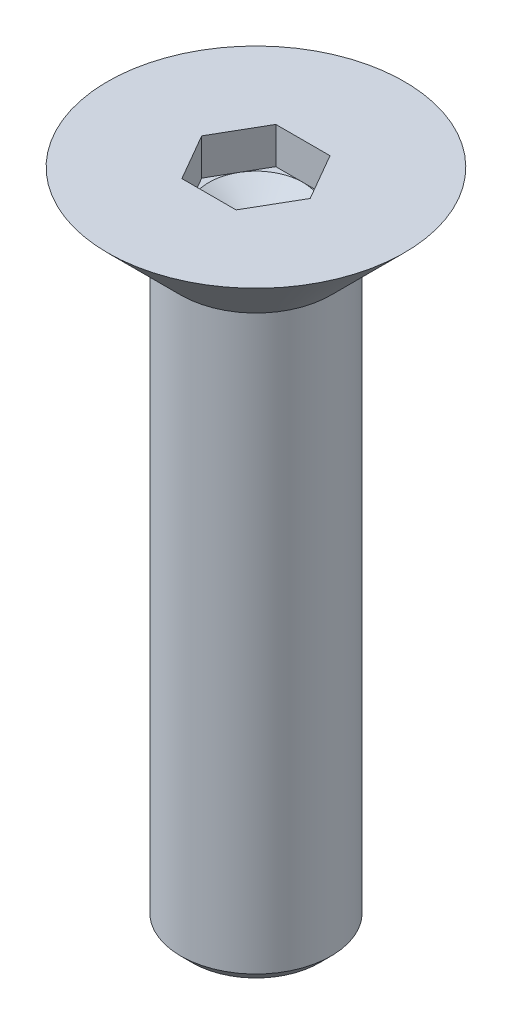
ISO-10303-21;
HEADER;
FILE_DESCRIPTION(('STEP AP214'),'2;1');
FILE_NAME('part.step','',(''),(''),'','','');
FILE_SCHEMA(('AUTOMOTIVE_DESIGN { 1 0 10303 214 1 1 1 1 }'));
ENDSEC;
DATA;
#1=APPLICATION_CONTEXT('core data for automotive mechanical design processes');
#2=APPLICATION_PROTOCOL_DEFINITION('international standard','automotive_design',2000,#1);
#3=PRODUCT_CONTEXT('',#1,'mechanical');
#4=PRODUCT('Part','Part','',(#3));
#5=PRODUCT_RELATED_PRODUCT_CATEGORY('part','',(#4));
#6=PRODUCT_DEFINITION_FORMATION('','',#4);
#7=PRODUCT_DEFINITION_CONTEXT('part definition',#1,'design');
#8=PRODUCT_DEFINITION('design','',#6,#7);
#9=PRODUCT_DEFINITION_SHAPE('','',#8);
#10=(LENGTH_UNIT() NAMED_UNIT(*) SI_UNIT(.MILLI.,.METRE.));
#11=(NAMED_UNIT(*) PLANE_ANGLE_UNIT() SI_UNIT($,.RADIAN.));
#12=(NAMED_UNIT(*) SI_UNIT($,.STERADIAN.) SOLID_ANGLE_UNIT());
#13=UNCERTAINTY_MEASURE_WITH_UNIT(LENGTH_MEASURE(1.E-05),#10,'distance_accuracy_value','');
#14=(GEOMETRIC_REPRESENTATION_CONTEXT(3) GLOBAL_UNCERTAINTY_ASSIGNED_CONTEXT((#13)) GLOBAL_UNIT_ASSIGNED_CONTEXT((#10,
#11,#12)) REPRESENTATION_CONTEXT('',''));
#15=CARTESIAN_POINT('',(0.,0.,0.));
#16=DIRECTION('',(0.,0.,1.));
#17=DIRECTION('',(1.,0.,0.));
#18=AXIS2_PLACEMENT_3D('',#15,#16,#17);
#19=CARTESIAN_POINT('',(0.,-35.,0.));
#20=DIRECTION('',(0.,1.,0.));
#21=DIRECTION('',(0.,0.,1.));
#22=AXIS2_PLACEMENT_3D('',#19,#20,#21);
#23=CYLINDRICAL_SURFACE('',#22,4.);
#24=CARTESIAN_POINT('',(0.,-34.375,0.));
#25=DIRECTION('',(0.,1.,0.));
#26=DIRECTION('',(0.,0.,1.));
#27=AXIS2_PLACEMENT_3D('',#24,#25,#26);
#28=CIRCLE('',#27,4.);
#29=CARTESIAN_POINT('',(0.,-34.375,4.));
#30=VERTEX_POINT('',#29);
#31=EDGE_CURVE('E45',#30,#30,#28,.T.);
#32=ORIENTED_EDGE('',*,*,#31,.T.);
#33=EDGE_LOOP('',(#32));
#34=FACE_BOUND('',#33,.T.);
#35=CARTESIAN_POINT('',(0.,-3.89999999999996,0.));
#36=DIRECTION('',(0.,1.,0.));
#37=DIRECTION('',(0.,0.,1.));
#38=AXIS2_PLACEMENT_3D('',#35,#36,#37);
#39=CIRCLE('',#38,4.);
#40=CARTESIAN_POINT('',(0.,-3.89999999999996,4.));
#41=VERTEX_POINT('',#40);
#42=EDGE_CURVE('E155',#41,#41,#39,.T.);
#43=ORIENTED_EDGE('',*,*,#42,.F.);
#44=EDGE_LOOP('',(#43));
#45=FACE_BOUND('',#44,.T.);
#46=ADVANCED_FACE('F37',(#34,#45),#23,.T.);
#47=CARTESIAN_POINT('',(0.,-35.,0.));
#48=DIRECTION('',(0.,1.,0.));
#49=DIRECTION('',(0.,0.,1.));
#50=AXIS2_PLACEMENT_3D('',#47,#48,#49);
#51=PLANE('',#50);
#52=CARTESIAN_POINT('',(0.,-35.,0.));
#53=DIRECTION('',(0.,1.,0.));
#54=DIRECTION('',(0.,0.,1.));
#55=AXIS2_PLACEMENT_3D('',#52,#53,#54);
#56=CIRCLE('',#55,3.375);
#57=CARTESIAN_POINT('',(0.,-35.,3.375));
#58=VERTEX_POINT('',#57);
#59=EDGE_CURVE('E11',#58,#58,#56,.F.);
#60=ORIENTED_EDGE('',*,*,#59,.T.);
#61=EDGE_LOOP('',(#60));
#62=FACE_BOUND('',#61,.T.);
#63=ADVANCED_FACE('F174',(#62),#51,.F.);
#64=CARTESIAN_POINT('',(0.,-34.375,0.));
#65=DIRECTION('',(0.,1.,0.));
#66=DIRECTION('',(0.,0.,1.));
#67=AXIS2_PLACEMENT_3D('',#64,#65,#66);
#68=CONICAL_SURFACE('',#67,4.,0.78539816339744);
#69=ORIENTED_EDGE('',*,*,#59,.F.);
#70=EDGE_LOOP('',(#69));
#71=FACE_BOUND('',#70,.T.);
#72=ORIENTED_EDGE('',*,*,#31,.F.);
#73=EDGE_LOOP('',(#72));
#74=FACE_BOUND('',#73,.T.);
#75=ADVANCED_FACE('F171',(#71,#74),#68,.T.);
#76=CARTESIAN_POINT('',(0.,-3.89999999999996,0.));
#77=DIRECTION('',(0.,1.,0.));
#78=DIRECTION('',(0.,0.,1.));
#79=AXIS2_PLACEMENT_3D('',#76,#77,#78);
#80=CONICAL_SURFACE('',#79,4.,0.785398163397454);
#81=CARTESIAN_POINT('',(0.,0.,0.));
#82=DIRECTION('',(0.,1.,0.));
#83=DIRECTION('',(0.,0.,1.));
#84=AXIS2_PLACEMENT_3D('',#81,#82,#83);
#85=CIRCLE('',#84,7.9);
#86=CARTESIAN_POINT('',(0.,0.,7.9));
#87=VERTEX_POINT('',#86);
#88=EDGE_CURVE('E161',#87,#87,#85,.T.);
#89=ORIENTED_EDGE('',*,*,#88,.F.);
#90=EDGE_LOOP('',(#89));
#91=FACE_BOUND('',#90,.T.);
#92=ORIENTED_EDGE('',*,*,#42,.T.);
#93=EDGE_LOOP('',(#92));
#94=FACE_BOUND('',#93,.T.);
#95=ADVANCED_FACE('F173',(#91,#94),#80,.T.);
#96=CARTESIAN_POINT('',(0.,0.,0.));
#97=DIRECTION('',(0.,1.,0.));
#98=DIRECTION('',(0.,0.,1.));
#99=AXIS2_PLACEMENT_3D('',#96,#97,#98);
#100=PLANE('',#99);
#101=DIRECTION('',(0.499999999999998,0.,-0.86602540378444));
#102=VECTOR('',#101,1.);
#103=CARTESIAN_POINT('',(1.44337567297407,0.,2.5));
#104=LINE('',#103,#102);
#105=CARTESIAN_POINT('',(1.44337567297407,0.,2.5));
#106=VERTEX_POINT('',#105);
#107=CARTESIAN_POINT('',(2.88675134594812,0.,0.));
#108=VERTEX_POINT('',#107);
#109=EDGE_CURVE('E398',#106,#108,#104,.T.);
#110=ORIENTED_EDGE('',*,*,#109,.F.);
#111=DIRECTION('',(1.,0.,0.));
#112=VECTOR('',#111,1.);
#113=CARTESIAN_POINT('',(-1.44337567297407,0.,2.5));
#114=LINE('',#113,#112);
#115=CARTESIAN_POINT('',(-1.44337567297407,0.,2.5));
#116=VERTEX_POINT('',#115);
#117=EDGE_CURVE('E396',#116,#106,#114,.T.);
#118=ORIENTED_EDGE('',*,*,#117,.F.);
#119=DIRECTION('',(0.499999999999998,0.,0.86602540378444));
#120=VECTOR('',#119,1.);
#121=CARTESIAN_POINT('',(-1.44337567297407,0.,2.5));
#122=LINE('',#121,#120);
#123=CARTESIAN_POINT('',(-2.88675134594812,0.,0.));
#124=VERTEX_POINT('',#123);
#125=EDGE_CURVE('E114',#124,#116,#122,.T.);
#126=ORIENTED_EDGE('',*,*,#125,.F.);
#127=DIRECTION('',(-0.499999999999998,0.,0.86602540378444));
#128=VECTOR('',#127,1.);
#129=CARTESIAN_POINT('',(-1.44337567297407,0.,-2.5));
#130=LINE('',#129,#128);
#131=CARTESIAN_POINT('',(-1.44337567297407,0.,-2.5));
#132=VERTEX_POINT('',#131);
#133=EDGE_CURVE('E107',#132,#124,#130,.T.);
#134=ORIENTED_EDGE('',*,*,#133,.F.);
#135=DIRECTION('',(-1.,0.,0.));
#136=VECTOR('',#135,1.);
#137=CARTESIAN_POINT('',(-1.44337567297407,0.,-2.5));
#138=LINE('',#137,#136);
#139=CARTESIAN_POINT('',(1.44337567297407,0.,-2.5));
#140=VERTEX_POINT('',#139);
#141=EDGE_CURVE('E111',#140,#132,#138,.T.);
#142=ORIENTED_EDGE('',*,*,#141,.F.);
#143=DIRECTION('',(-0.499999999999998,0.,-0.86602540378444));
#144=VECTOR('',#143,1.);
#145=CARTESIAN_POINT('',(1.44337567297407,0.,-2.5));
#146=LINE('',#145,#144);
#147=EDGE_CURVE('E403',#108,#140,#146,.T.);
#148=ORIENTED_EDGE('',*,*,#147,.F.);
#149=EDGE_LOOP('',(#110,#118,#126,#134,#142,#148));
#150=FACE_BOUND('',#149,.T.);
#151=ORIENTED_EDGE('',*,*,#88,.T.);
#152=EDGE_LOOP('',(#151));
#153=FACE_BOUND('',#152,.T.);
#154=ADVANCED_FACE('F109',(#150,#153),#100,.T.);
#155=CARTESIAN_POINT('',(-1.44337567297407,-1.95,-2.5));
#156=DIRECTION('',(0.,0.,-1.));
#157=DIRECTION('',(-1.,0.,0.));
#158=AXIS2_PLACEMENT_3D('',#155,#156,#157);
#159=PLANE('',#158);
#160=ORIENTED_EDGE('',*,*,#141,.T.);
#161=DIRECTION('',(0.,1.,0.));
#162=VECTOR('',#161,1.);
#163=CARTESIAN_POINT('',(-1.44337567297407,-1.95,-2.5));
#164=LINE('',#163,#162);
#165=CARTESIAN_POINT('',(-1.44337567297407,-1.95,-2.5));
#166=VERTEX_POINT('',#165);
#167=EDGE_CURVE('E126',#166,#132,#164,.T.);
#168=ORIENTED_EDGE('',*,*,#167,.F.);
#169=DIRECTION('',(-1.,0.,0.));
#170=VECTOR('',#169,1.);
#171=CARTESIAN_POINT('',(-1.44337567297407,-1.95,-2.5));
#172=LINE('',#171,#170);
#173=CARTESIAN_POINT('',(0.,-1.95,-2.5));
#174=VERTEX_POINT('',#173);
#175=EDGE_CURVE('E410',#174,#166,#172,.T.);
#176=ORIENTED_EDGE('',*,*,#175,.F.);
#177=CARTESIAN_POINT('',(1.44337567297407,-1.95,-2.5));
#178=VERTEX_POINT('',#177);
#179=EDGE_CURVE('E411',#178,#174,#172,.T.);
#180=ORIENTED_EDGE('',*,*,#179,.F.);
#181=DIRECTION('',(0.,1.,0.));
#182=VECTOR('',#181,1.);
#183=CARTESIAN_POINT('',(1.44337567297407,-1.95,-2.5));
#184=LINE('',#183,#182);
#185=EDGE_CURVE('E130',#178,#140,#184,.T.);
#186=ORIENTED_EDGE('',*,*,#185,.T.);
#187=EDGE_LOOP('',(#160,#168,#176,#180,#186));
#188=FACE_BOUND('',#187,.T.);
#189=ADVANCED_FACE('F124',(#188),#159,.F.);
#190=CARTESIAN_POINT('',(1.44337567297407,-1.95,-2.5));
#191=DIRECTION('',(0.86602540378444,0.,-0.499999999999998));
#192=DIRECTION('',(-0.499999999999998,0.,-0.86602540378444));
#193=AXIS2_PLACEMENT_3D('',#190,#191,#192);
#194=PLANE('',#193);
#195=ORIENTED_EDGE('',*,*,#147,.T.);
#196=ORIENTED_EDGE('',*,*,#185,.F.);
#197=DIRECTION('',(-0.499999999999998,0.,-0.86602540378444));
#198=VECTOR('',#197,1.);
#199=CARTESIAN_POINT('',(1.44337567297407,-1.95,-2.5));
#200=LINE('',#199,#198);
#201=CARTESIAN_POINT('',(2.1650635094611,-1.95,-1.25));
#202=VERTEX_POINT('',#201);
#203=EDGE_CURVE('E148',#202,#178,#200,.T.);
#204=ORIENTED_EDGE('',*,*,#203,.F.);
#205=CARTESIAN_POINT('',(2.88675134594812,-1.95,0.));
#206=VERTEX_POINT('',#205);
#207=EDGE_CURVE('E139',#206,#202,#200,.T.);
#208=ORIENTED_EDGE('',*,*,#207,.F.);
#209=DIRECTION('',(0.,1.,0.));
#210=VECTOR('',#209,1.);
#211=CARTESIAN_POINT('',(2.88675134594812,-1.95,0.));
#212=LINE('',#211,#210);
#213=EDGE_CURVE('E388',#206,#108,#212,.T.);
#214=ORIENTED_EDGE('',*,*,#213,.T.);
#215=EDGE_LOOP('',(#195,#196,#204,#208,#214));
#216=FACE_BOUND('',#215,.T.);
#217=ADVANCED_FACE('F213',(#216),#194,.F.);
#218=CARTESIAN_POINT('',(1.44337567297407,-1.95,2.5));
#219=DIRECTION('',(0.86602540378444,0.,0.499999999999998));
#220=DIRECTION('',(0.499999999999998,0.,-0.86602540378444));
#221=AXIS2_PLACEMENT_3D('',#218,#219,#220);
#222=PLANE('',#221);
#223=ORIENTED_EDGE('',*,*,#109,.T.);
#224=ORIENTED_EDGE('',*,*,#213,.F.);
#225=DIRECTION('',(0.499999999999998,0.,-0.86602540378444));
#226=VECTOR('',#225,1.);
#227=CARTESIAN_POINT('',(1.44337567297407,-1.95,2.5));
#228=LINE('',#227,#226);
#229=CARTESIAN_POINT('',(2.1650635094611,-1.95,1.24999999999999));
#230=VERTEX_POINT('',#229);
#231=EDGE_CURVE('E379',#230,#206,#228,.T.);
#232=ORIENTED_EDGE('',*,*,#231,.F.);
#233=CARTESIAN_POINT('',(1.44337567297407,-1.95,2.5));
#234=VERTEX_POINT('',#233);
#235=EDGE_CURVE('E52',#234,#230,#228,.T.);
#236=ORIENTED_EDGE('',*,*,#235,.F.);
#237=DIRECTION('',(0.,1.,0.));
#238=VECTOR('',#237,1.);
#239=CARTESIAN_POINT('',(1.44337567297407,-1.95,2.5));
#240=LINE('',#239,#238);
#241=EDGE_CURVE('E371',#234,#106,#240,.T.);
#242=ORIENTED_EDGE('',*,*,#241,.T.);
#243=EDGE_LOOP('',(#223,#224,#232,#236,#242));
#244=FACE_BOUND('',#243,.T.);
#245=ADVANCED_FACE('F221',(#244),#222,.F.);
#246=CARTESIAN_POINT('',(-1.44337567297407,-1.95,2.5));
#247=DIRECTION('',(0.,0.,1.));
#248=DIRECTION('',(1.,0.,0.));
#249=AXIS2_PLACEMENT_3D('',#246,#247,#248);
#250=PLANE('',#249);
#251=ORIENTED_EDGE('',*,*,#117,.T.);
#252=ORIENTED_EDGE('',*,*,#241,.F.);
#253=DIRECTION('',(1.,0.,0.));
#254=VECTOR('',#253,1.);
#255=CARTESIAN_POINT('',(-1.44337567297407,-1.95,2.5));
#256=LINE('',#255,#254);
#257=CARTESIAN_POINT('',(0.,-1.95,2.5));
#258=VERTEX_POINT('',#257);
#259=EDGE_CURVE('E363',#258,#234,#256,.T.);
#260=ORIENTED_EDGE('',*,*,#259,.F.);
#261=CARTESIAN_POINT('',(-1.44337567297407,-1.95,2.5));
#262=VERTEX_POINT('',#261);
#263=EDGE_CURVE('E369',#262,#258,#256,.T.);
#264=ORIENTED_EDGE('',*,*,#263,.F.);
#265=DIRECTION('',(0.,1.,0.));
#266=VECTOR('',#265,1.);
#267=CARTESIAN_POINT('',(-1.44337567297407,-1.95,2.5));
#268=LINE('',#267,#266);
#269=EDGE_CURVE('E144',#262,#116,#268,.T.);
#270=ORIENTED_EDGE('',*,*,#269,.T.);
#271=EDGE_LOOP('',(#251,#252,#260,#264,#270));
#272=FACE_BOUND('',#271,.T.);
#273=ADVANCED_FACE('F230',(#272),#250,.F.);
#274=CARTESIAN_POINT('',(-1.44337567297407,-1.95,2.5));
#275=DIRECTION('',(-0.86602540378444,0.,0.499999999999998));
#276=DIRECTION('',(0.499999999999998,0.,0.86602540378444));
#277=AXIS2_PLACEMENT_3D('',#274,#275,#276);
#278=PLANE('',#277);
#279=ORIENTED_EDGE('',*,*,#125,.T.);
#280=ORIENTED_EDGE('',*,*,#269,.F.);
#281=DIRECTION('',(0.499999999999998,0.,0.86602540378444));
#282=VECTOR('',#281,1.);
#283=CARTESIAN_POINT('',(-1.44337567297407,-1.95,2.5));
#284=LINE('',#283,#282);
#285=CARTESIAN_POINT('',(-2.1650635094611,-1.95,1.24999999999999));
#286=VERTEX_POINT('',#285);
#287=EDGE_CURVE('E376',#286,#262,#284,.T.);
#288=ORIENTED_EDGE('',*,*,#287,.F.);
#289=CARTESIAN_POINT('',(-2.88675134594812,-1.95,0.));
#290=VERTEX_POINT('',#289);
#291=EDGE_CURVE('E373',#290,#286,#284,.T.);
#292=ORIENTED_EDGE('',*,*,#291,.F.);
#293=DIRECTION('',(0.,1.,0.));
#294=VECTOR('',#293,1.);
#295=CARTESIAN_POINT('',(-2.88675134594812,-1.95,0.));
#296=LINE('',#295,#294);
#297=EDGE_CURVE('E138',#290,#124,#296,.T.);
#298=ORIENTED_EDGE('',*,*,#297,.T.);
#299=EDGE_LOOP('',(#279,#280,#288,#292,#298));
#300=FACE_BOUND('',#299,.T.);
#301=ADVANCED_FACE('F239',(#300),#278,.F.);
#302=CARTESIAN_POINT('',(-1.44337567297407,-1.95,-2.5));
#303=DIRECTION('',(-0.86602540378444,0.,-0.499999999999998));
#304=DIRECTION('',(-0.499999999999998,0.,0.86602540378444));
#305=AXIS2_PLACEMENT_3D('',#302,#303,#304);
#306=PLANE('',#305);
#307=ORIENTED_EDGE('',*,*,#133,.T.);
#308=ORIENTED_EDGE('',*,*,#297,.F.);
#309=DIRECTION('',(-0.499999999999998,0.,0.86602540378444));
#310=VECTOR('',#309,1.);
#311=CARTESIAN_POINT('',(-1.44337567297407,-1.95,-2.5));
#312=LINE('',#311,#310);
#313=CARTESIAN_POINT('',(-2.1650635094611,-1.95,-1.25));
#314=VERTEX_POINT('',#313);
#315=EDGE_CURVE('E414',#314,#290,#312,.T.);
#316=ORIENTED_EDGE('',*,*,#315,.F.);
#317=EDGE_CURVE('E136',#166,#314,#312,.T.);
#318=ORIENTED_EDGE('',*,*,#317,.F.);
#319=ORIENTED_EDGE('',*,*,#167,.T.);
#320=EDGE_LOOP('',(#307,#308,#316,#318,#319));
#321=FACE_BOUND('',#320,.T.);
#322=ADVANCED_FACE('F133',(#321),#306,.F.);
#323=CARTESIAN_POINT('',(4.33012701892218,-1.95,-2.5));
#324=DIRECTION('',(0.,1.,0.));
#325=DIRECTION('',(0.,0.,1.));
#326=AXIS2_PLACEMENT_3D('',#323,#324,#325);
#327=PLANE('',#326);
#328=CARTESIAN_POINT('',(0.,-1.95,0.));
#329=DIRECTION('',(0.,1.,0.));
#330=DIRECTION('',(0.,0.,1.));
#331=AXIS2_PLACEMENT_3D('',#328,#329,#330);
#332=CIRCLE('',#331,2.5);
#333=EDGE_CURVE('E157',#286,#258,#332,.T.);
#334=ORIENTED_EDGE('',*,*,#333,.F.);
#335=ORIENTED_EDGE('',*,*,#287,.T.);
#336=ORIENTED_EDGE('',*,*,#263,.T.);
#337=EDGE_LOOP('',(#334,#335,#336));
#338=FACE_BOUND('',#337,.T.);
#339=ADVANCED_FACE('F256',(#338),#327,.T.);
#340=EDGE_CURVE('E420',#314,#286,#332,.T.);
#341=ORIENTED_EDGE('',*,*,#340,.F.);
#342=ORIENTED_EDGE('',*,*,#315,.T.);
#343=ORIENTED_EDGE('',*,*,#291,.T.);
#344=EDGE_LOOP('',(#341,#342,#343));
#345=FACE_BOUND('',#344,.T.);
#346=ADVANCED_FACE('F264',(#345),#327,.T.);
#347=EDGE_CURVE('E424',#174,#314,#332,.T.);
#348=ORIENTED_EDGE('',*,*,#347,.F.);
#349=ORIENTED_EDGE('',*,*,#175,.T.);
#350=ORIENTED_EDGE('',*,*,#317,.T.);
#351=EDGE_LOOP('',(#348,#349,#350));
#352=FACE_BOUND('',#351,.T.);
#353=ADVANCED_FACE('F274',(#352),#327,.T.);
#354=EDGE_CURVE('E423',#202,#174,#332,.T.);
#355=ORIENTED_EDGE('',*,*,#354,.F.);
#356=ORIENTED_EDGE('',*,*,#203,.T.);
#357=ORIENTED_EDGE('',*,*,#179,.T.);
#358=EDGE_LOOP('',(#355,#356,#357));
#359=FACE_BOUND('',#358,.T.);
#360=ADVANCED_FACE('F282',(#359),#327,.T.);
#361=EDGE_CURVE('E156',#230,#202,#332,.T.);
#362=ORIENTED_EDGE('',*,*,#361,.F.);
#363=ORIENTED_EDGE('',*,*,#231,.T.);
#364=ORIENTED_EDGE('',*,*,#207,.T.);
#365=EDGE_LOOP('',(#362,#363,#364));
#366=FACE_BOUND('',#365,.T.);
#367=ADVANCED_FACE('F290',(#366),#327,.T.);
#368=EDGE_CURVE('E152',#258,#230,#332,.T.);
#369=ORIENTED_EDGE('',*,*,#368,.F.);
#370=ORIENTED_EDGE('',*,*,#259,.T.);
#371=ORIENTED_EDGE('',*,*,#235,.T.);
#372=EDGE_LOOP('',(#369,#370,#371));
#373=FACE_BOUND('',#372,.T.);
#374=ADVANCED_FACE('F267',(#373),#327,.T.);
#375=CARTESIAN_POINT('',(0.,-1.95,0.));
#376=DIRECTION('',(0.,1.,0.));
#377=DIRECTION('',(0.,0.,1.));
#378=AXIS2_PLACEMENT_3D('',#375,#376,#377);
#379=CONICAL_SURFACE('',#378,2.5,1.0471975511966);
#380=CARTESIAN_POINT('',(0.,-3.39337567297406,0.));
#381=VERTEX_POINT('',#380);
#382=VERTEX_LOOP('',#381);
#383=FACE_BOUND('',#382,.T.);
#384=ORIENTED_EDGE('',*,*,#368,.T.);
#385=ORIENTED_EDGE('',*,*,#361,.T.);
#386=ORIENTED_EDGE('',*,*,#354,.T.);
#387=ORIENTED_EDGE('',*,*,#347,.T.);
#388=ORIENTED_EDGE('',*,*,#340,.T.);
#389=ORIENTED_EDGE('',*,*,#333,.T.);
#390=EDGE_LOOP('',(#384,#385,#386,#387,#388,#389));
#391=FACE_BOUND('',#390,.T.);
#392=ADVANCED_FACE('F305',(#383,#391),#379,.F.);
#393=CLOSED_SHELL('',(#46,#63,#75,#95,#154,#189,#217,#245,#273,#301,#322,#339,#346,#353,#360,
#367,#374,#392));
#394=MANIFOLD_SOLID_BREP('B2',#393);
#395=ADVANCED_BREP_SHAPE_REPRESENTATION('',(#18,#394),#14);
#396=SHAPE_DEFINITION_REPRESENTATION(#9,#395);
ENDSEC;
END-ISO-10303-21;
